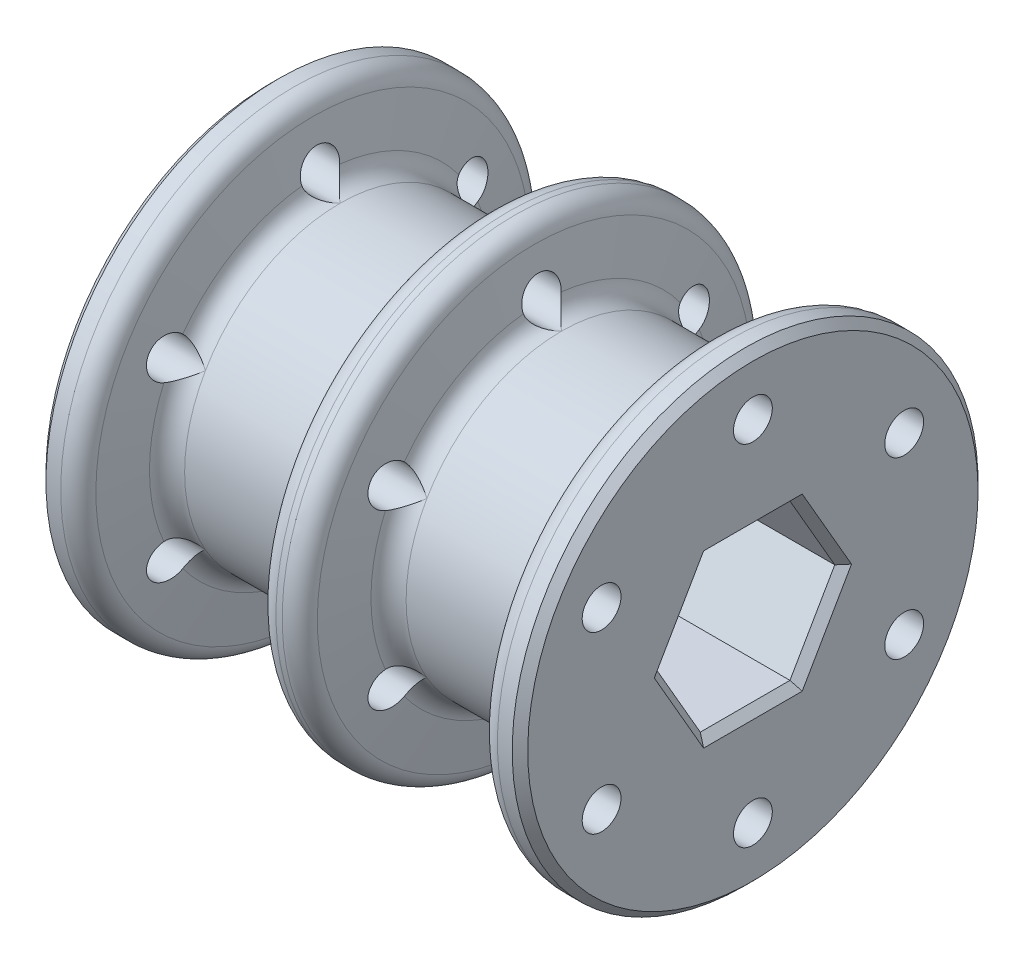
from build123d import *

# Parameters (mm, degrees)
FILLET1_R                    = 1.5875
CHAMFER1_SIZE                = 0.635
CUT_EXTRUDE1_DEPTH           = 48.733185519
FILLET2_R                    = 1.5875
F_1_8_0_125_DIAMETER_HOLE1_D = 3.175
CHAMFER2_SIZE                = 0.635


with BuildPart() as part:
    # Sketch1 → Revolve1 (revolve)
    with BuildSketch(Plane.XY):
        Polygon((0, 0), (0, 19.05), (3.175, 19.05), (4.294676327, 12.7), (16.994676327, 12.7), (18.114352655, 19.05), (21.289352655, 19.05), (22.409028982, 12.7), (35.109028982, 12.7), (36.22870531, 19.05), (39.40370531, 19.05), (39.40370531, 0), align=None)
    revolve(axis=Axis((39.40370531, 0, 0), (-1, 0, 0)))

    # Fillet1
    fillet1_edges = [part.edges().sort_by_distance(p)[0] for p in [
        (21.289352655, -19.05, 0),
        (18.114352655, -19.05, 0),
        (3.175, -19.05, 0),
        (36.22870531, -19.05, 0),
    ]]
    fillet(fillet1_edges, radius=FILLET1_R)

    # Chamfer1
    chamfer1_edges = [part.edges().sort_by_distance(p)[0] for p in [
        (0, -19.05, 0),
        (39.40370531, -19.05, 0),
    ]]
    chamfer(chamfer1_edges, length=CHAMFER1_SIZE)

    # Sketch2 → Cut-Extrude1 (cut, through all)
    with BuildSketch(Plane.ZY):
        Polygon((7.332348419, 0), (3.666174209, 6.35), (-3.666174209, 6.35), (-7.332348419, 0), (-3.666174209, -6.35), (3.666174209, -6.35), align=None)
    extrude(amount=-CUT_EXTRUDE1_DEPTH, mode=Mode.SUBTRACT)

    # Fillet2
    fillet2_edges = [part.edges().sort_by_distance(p)[0] for p in [
        (22.409028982, -12.7, 0),
        (16.994676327, -12.7, 0),
        (4.294676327, -12.7, 0),
        (35.109028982, -12.7, 0),
    ]]
    fillet(fillet2_edges, radius=FILLET2_R)

    # 1_8 _0.125_ Diameter Hole1 (through all)
    with Locations(Plane.ZY):
        with Locations((0, 14.2875), (12.373337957, 7.14375), (12.373337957, -7.14375), (0, -14.2875), (-12.373337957, -7.14375), (-12.373337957, 7.14375)):
            Hole(F_1_8_0_125_DIAMETER_HOLE1_D / 2)

    # Chamfer2
    chamfer2_edges = [part.edges().sort_by_distance(p)[0] for p in [
        (39.40370531, -3.175, 5.499261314),
        (39.40370531, -6.35, 0),
        (39.40370531, -3.175, -5.499261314),
        (39.40370531, 3.175, -5.499261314),
        (39.40370531, 6.35, 0),
        (39.40370531, 3.175, 5.499261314),
        (0, -3.175, 5.499261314),
        (0, 3.175, 5.499261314),
        (0, 6.35, 0),
        (0, 3.175, -5.499261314),
        (0, -3.175, -5.499261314),
        (0, -6.35, 0),
    ]]
    chamfer(chamfer2_edges, length=CHAMFER2_SIZE)


solid = part.part
